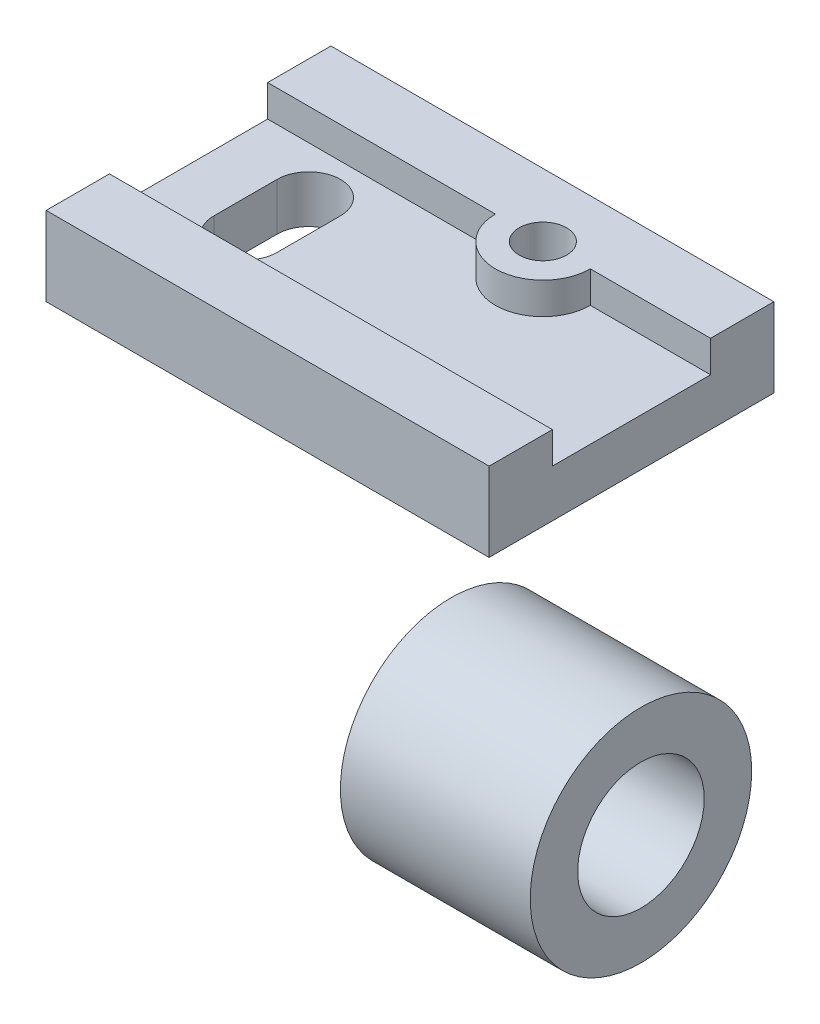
from build123d import *

# Parameters (mm, degrees)
SKETCH_1_W          = 140
SKETCH_1_H          = 90
EXTRUDE_1_DEPTH     = 25
CUT_EXTRUDE_1_DEPTH = 10
SKETCH_3_R          = 7.5
CUT_EXTRUDE_2_DEPTH = 169.300326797
CUT_EXTRUDE_3_DEPTH = 168.107749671
SKETCH_5_R          = 35
SKETCH_5_R_2        = 20
EXTRUDE_2_DEPTH     = 60


with BuildPart() as part:
    # Sketch 1 → Extrude 1 (new body)
    with BuildSketch(Plane(origin=(0, 0, 0), x_dir=(1, 0, 0), z_dir=(0, 1, 0))):
        with Locations((-70, -45)):
            Rectangle(SKETCH_1_W, SKETCH_1_H)
    extrude(amount=EXTRUDE_1_DEPTH)

    # Sketch 2 → Cut-Extrude 1 (cut)
    with BuildSketch(Plane(origin=(0, 25, 0), x_dir=(1, 0, 0), z_dir=(0, 1, 0))):
        with BuildLine():
            Line((-140, -20), (-68, -20))
            ThreePointArc((-68, -20), (-53, -35), (-38, -20))
            Line((-38, -20), (0, -20))
            Line((0, -20), (0, -70))
            Line((0, -70), (-140, -70))
            Line((-140, -70), (-140, -20))
        make_face()
    extrude(amount=-CUT_EXTRUDE_1_DEPTH, mode=Mode.SUBTRACT)

    # Sketch 3 → Cut-Extrude 2 (cut, through all)
    with BuildSketch(Plane(origin=(0, 25, 0), x_dir=(1, 0, 0), z_dir=(0, 1, 0))):
        with Locations(Location((-53, -20, 0), (0, 0, 270))):
            Circle(SKETCH_3_R)
    extrude(amount=-CUT_EXTRUDE_2_DEPTH, mode=Mode.SUBTRACT)

    # Sketch 4 → Cut-Extrude 3 (cut, through all)
    with BuildSketch(Plane(origin=(0, 15, 0), x_dir=(1, 0, 0), z_dir=(0, 1, 0))):
        with BuildLine():
            Line((-122, -35), (-122, -55))
            ThreePointArc((-122, -55), (-112, -65), (-102, -55))
            Line((-102, -55), (-102, -35))
            ThreePointArc((-102, -35), (-112, -25), (-122, -35))
        make_face()
    extrude(amount=-CUT_EXTRUDE_3_DEPTH, mode=Mode.SUBTRACT)


with BuildPart() as body_2:
    # Sketch 5 → Extrude 2 (new body)
    with BuildSketch(Plane(origin=(-40, 0, 0), x_dir=(0, 0, -1), z_dir=(1, 0, 0))):
        with Locations((-62, -80)):
            Circle(SKETCH_5_R)
        with Locations((-62, -80)):
            Circle(SKETCH_5_R_2, mode=Mode.SUBTRACT)
    extrude(amount=EXTRUDE_2_DEPTH)


solid = Compound([part.part, body_2.part])
